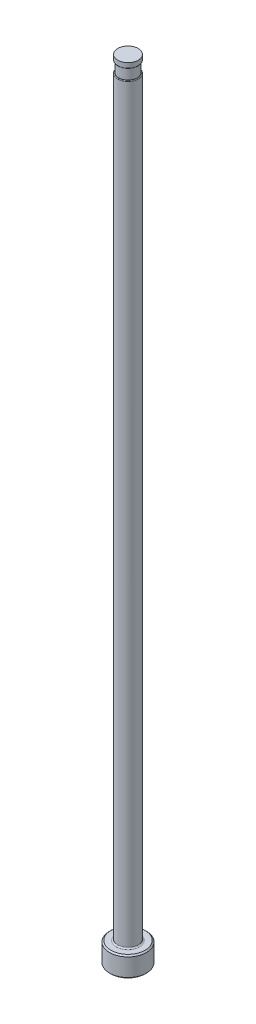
ISO-10303-21;
HEADER;
FILE_DESCRIPTION(('STEP AP214'),'2;1');
FILE_NAME('part.step','',(''),(''),'','','');
FILE_SCHEMA(('AUTOMOTIVE_DESIGN { 1 0 10303 214 1 1 1 1 }'));
ENDSEC;
DATA;
#1=APPLICATION_CONTEXT('core data for automotive mechanical design processes');
#2=APPLICATION_PROTOCOL_DEFINITION('international standard','automotive_design',2000,#1);
#3=PRODUCT_CONTEXT('',#1,'mechanical');
#4=PRODUCT('Part','Part','',(#3));
#5=PRODUCT_RELATED_PRODUCT_CATEGORY('part','',(#4));
#6=PRODUCT_DEFINITION_FORMATION('','',#4);
#7=PRODUCT_DEFINITION_CONTEXT('part definition',#1,'design');
#8=PRODUCT_DEFINITION('design','',#6,#7);
#9=PRODUCT_DEFINITION_SHAPE('','',#8);
#10=(LENGTH_UNIT() NAMED_UNIT(*) SI_UNIT(.MILLI.,.METRE.));
#11=(NAMED_UNIT(*) PLANE_ANGLE_UNIT() SI_UNIT($,.RADIAN.));
#12=(NAMED_UNIT(*) SI_UNIT($,.STERADIAN.) SOLID_ANGLE_UNIT());
#13=UNCERTAINTY_MEASURE_WITH_UNIT(LENGTH_MEASURE(1.E-05),#10,'distance_accuracy_value','');
#14=(GEOMETRIC_REPRESENTATION_CONTEXT(3) GLOBAL_UNCERTAINTY_ASSIGNED_CONTEXT((#13)) GLOBAL_UNIT_ASSIGNED_CONTEXT((#10,
#11,#12)) REPRESENTATION_CONTEXT('',''));
#15=CARTESIAN_POINT('',(0.,0.,0.));
#16=DIRECTION('',(0.,0.,1.));
#17=DIRECTION('',(1.,0.,0.));
#18=AXIS2_PLACEMENT_3D('',#15,#16,#17);
#19=CARTESIAN_POINT('',(-1.98373999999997,151.384,0.));
#20=DIRECTION('',(0.,1.,0.));
#21=DIRECTION('',(0.,0.,1.));
#22=AXIS2_PLACEMENT_3D('',#19,#20,#21);
#23=PLANE('',#22);
#24=CARTESIAN_POINT('',(0.,151.384,0.));
#25=DIRECTION('',(0.,1.,0.));
#26=DIRECTION('',(0.,0.,1.));
#27=AXIS2_PLACEMENT_3D('',#24,#25,#26);
#28=CIRCLE('',#27,1.85165999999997);
#29=CARTESIAN_POINT('',(0.,151.384,1.85165999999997));
#30=VERTEX_POINT('',#29);
#31=EDGE_CURVE('E11',#30,#30,#28,.F.);
#32=ORIENTED_EDGE('',*,*,#31,.T.);
#33=EDGE_LOOP('',(#32));
#34=FACE_BOUND('',#33,.T.);
#35=CARTESIAN_POINT('',(0.,151.384,0.));
#36=DIRECTION('',(0.,1.,0.));
#37=DIRECTION('',(0.,0.,1.));
#38=AXIS2_PLACEMENT_3D('',#35,#36,#37);
#39=CIRCLE('',#38,1.78053999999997);
#40=CARTESIAN_POINT('',(0.,151.384,1.78053999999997));
#41=VERTEX_POINT('',#40);
#42=EDGE_CURVE('E78',#41,#41,#39,.T.);
#43=ORIENTED_EDGE('',*,*,#42,.T.);
#44=EDGE_LOOP('',(#43));
#45=FACE_BOUND('',#44,.T.);
#46=ADVANCED_FACE('F36',(#34,#45),#23,.F.);
#47=CARTESIAN_POINT('',(0.,259.958771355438,0.));
#48=DIRECTION('',(0.,1.,0.));
#49=DIRECTION('',(0.,0.,1.));
#50=AXIS2_PLACEMENT_3D('',#47,#48,#49);
#51=CYLINDRICAL_SURFACE('',#50,1.98373999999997);
#52=DIRECTION('',(0.,1.,0.));
#53=VECTOR('',#52,1.);
#54=CARTESIAN_POINT('',(-1.78053999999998,259.958771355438,-0.874586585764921));
#55=LINE('',#54,#53);
#56=CARTESIAN_POINT('',(-1.78053999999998,149.225,-0.874586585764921));
#57=VERTEX_POINT('',#56);
#58=CARTESIAN_POINT('',(-1.78053999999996,86.868,-0.874586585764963));
#59=VERTEX_POINT('',#58);
#60=EDGE_CURVE('E73',#57,#59,#55,.F.);
#61=ORIENTED_EDGE('',*,*,#60,.F.);
#62=CARTESIAN_POINT('',(0.,149.225,0.));
#63=DIRECTION('',(0.,-1.,0.));
#64=DIRECTION('',(0.,0.,-1.));
#65=AXIS2_PLACEMENT_3D('',#62,#63,#64);
#66=CIRCLE('',#65,1.98373999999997);
#67=CARTESIAN_POINT('',(-1.78053999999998,149.225,0.874586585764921));
#68=VERTEX_POINT('',#67);
#69=EDGE_CURVE('E51',#57,#68,#66,.T.);
#70=ORIENTED_EDGE('',*,*,#69,.T.);
#71=DIRECTION('',(0.,1.,0.));
#72=VECTOR('',#71,1.);
#73=CARTESIAN_POINT('',(-1.78053999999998,259.958771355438,0.874586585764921));
#74=LINE('',#73,#72);
#75=CARTESIAN_POINT('',(-1.78053999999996,86.868,0.874586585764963));
#76=VERTEX_POINT('',#75);
#77=EDGE_CURVE('E84',#76,#68,#74,.T.);
#78=ORIENTED_EDGE('',*,*,#77,.F.);
#79=CARTESIAN_POINT('',(-1.78053999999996,86.868,-0.874586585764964));
#80=CARTESIAN_POINT('',(-1.78053865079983,86.8352968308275,-0.874582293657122));
#81=CARTESIAN_POINT('',(-1.78104579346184,86.8026048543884,-0.873557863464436));
#82=CARTESIAN_POINT('',(-1.78306050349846,86.7373726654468,-0.869440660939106));
#83=CARTESIAN_POINT('',(-1.78456837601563,86.7048325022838,-0.866347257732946));
#84=CARTESIAN_POINT('',(-1.79058935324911,86.6073142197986,-0.853877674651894));
#85=CARTESIAN_POINT('',(-1.7965995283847,86.542794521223,-0.841311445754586));
#86=CARTESIAN_POINT('',(-1.81216655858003,86.416456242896,-0.807234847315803));
#87=CARTESIAN_POINT('',(-1.82173064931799,86.3546434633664,-0.785706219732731));
#88=CARTESIAN_POINT('',(-1.84353272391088,86.2358109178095,-0.733090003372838));
#89=CARTESIAN_POINT('',(-1.85576409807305,86.1787797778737,-0.702025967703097));
#90=CARTESIAN_POINT('',(-1.87864294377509,86.0836691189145,-0.637816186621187));
#91=CARTESIAN_POINT('',(-1.88904107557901,86.0441900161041,-0.606655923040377));
#92=CARTESIAN_POINT('',(-1.9096749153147,85.9709072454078,-0.538182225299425));
#93=CARTESIAN_POINT('',(-1.91991077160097,85.9370980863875,-0.50087481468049));
#94=CARTESIAN_POINT('',(-1.93765949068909,85.8812104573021,-0.426534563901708));
#95=CARTESIAN_POINT('',(-1.94535058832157,85.8581335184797,-0.390297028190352));
#96=CARTESIAN_POINT('',(-1.95906883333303,85.8181265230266,-0.31426420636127));
#97=CARTESIAN_POINT('',(-1.965096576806,85.8011942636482,-0.274470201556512));
#98=CARTESIAN_POINT('',(-1.97485334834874,85.7742257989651,-0.192104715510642));
#99=CARTESIAN_POINT('',(-1.97857112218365,85.7642233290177,-0.149520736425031));
#100=CARTESIAN_POINT('',(-1.98320696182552,85.751797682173,-0.0631103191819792));
#101=CARTESIAN_POINT('',(-1.98412600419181,85.7493718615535,-0.0192843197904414));
#102=CARTESIAN_POINT('',(-1.98310107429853,85.752100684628,0.0642372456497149));
#103=CARTESIAN_POINT('',(-1.98140057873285,85.7566106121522,0.103958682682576));
#104=CARTESIAN_POINT('',(-1.97575922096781,85.7718264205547,0.182020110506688));
#105=CARTESIAN_POINT('',(-1.97181856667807,85.7825317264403,0.220360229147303));
#106=CARTESIAN_POINT('',(-1.96206992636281,85.8097141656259,0.294827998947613));
#107=CARTESIAN_POINT('',(-1.95625507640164,85.8262125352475,0.330946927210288));
#108=CARTESIAN_POINT('',(-1.9432907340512,85.8643152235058,0.400107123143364));
#109=CARTESIAN_POINT('',(-1.93614084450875,85.885921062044,0.433147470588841));
#110=CARTESIAN_POINT('',(-1.92029960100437,85.9359613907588,0.498934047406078));
#111=CARTESIAN_POINT('',(-1.91152531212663,85.9648706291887,0.531297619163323));
#112=CARTESIAN_POINT('',(-1.89377241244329,86.0270184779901,0.591469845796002));
#113=CARTESIAN_POINT('',(-1.88479370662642,86.0602591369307,0.619276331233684));
#114=CARTESIAN_POINT('',(-1.86569807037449,86.1363604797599,0.674838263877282));
#115=CARTESIAN_POINT('',(-1.85566100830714,86.1798824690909,0.701713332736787));
#116=CARTESIAN_POINT('',(-1.83693898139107,86.2704245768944,0.749356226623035));
#117=CARTESIAN_POINT('',(-1.82825528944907,86.3174479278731,0.770118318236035));
#118=CARTESIAN_POINT('',(-1.8111557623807,86.4241808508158,0.809629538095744));
#119=CARTESIAN_POINT('',(-1.8031876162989,86.4844653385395,0.827017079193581));
#120=CARTESIAN_POINT('',(-1.79067795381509,86.6070954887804,0.853764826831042));
#121=CARTESIAN_POINT('',(-1.78613494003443,86.6694402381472,0.863128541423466));
#122=CARTESIAN_POINT('',(-1.78247943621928,86.7547444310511,0.870628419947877));
#123=CARTESIAN_POINT('',(-1.78175210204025,86.7773874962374,0.872115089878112));
#124=CARTESIAN_POINT('',(-1.78078289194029,86.8226849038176,0.874092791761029));
#125=CARTESIAN_POINT('',(-1.78054010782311,86.8453391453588,0.874585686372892));
#126=CARTESIAN_POINT('',(-1.78053999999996,86.868,0.874586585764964));
#127=B_SPLINE_CURVE_WITH_KNOTS('',3,(#79,#80,#81,#82,#83,#84,#85,#86,#87,#88,#89,#90,#91,#92,
#93,#94,#95,#96,#97,#98,#99,#100,#101,#102,#103,#104,#105,#106,#107,#108,#109,#110,#111,#112,
#113,#114,#115,#116,#117,#118,#119,#120,#121,#122,#123,#124,#125,#126),.UNSPECIFIED.,.F.,.F.,(4,
2,2,2,2,2,2,2,2,2,2,2,2,2,2,2,2,2,2,2,2,2,2,4),(0.,0.098066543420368,0.196163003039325,
0.39341501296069,0.591070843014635,0.78824232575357,0.941736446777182,1.09508104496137,
1.22546509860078,1.35580236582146,1.48676976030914,1.6176914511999,1.73715752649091,
1.85661251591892,1.97651005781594,2.0964433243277,2.22876073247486,2.36114094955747,
2.51695507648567,2.67291488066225,2.86196277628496,3.05092797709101,3.11901829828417,
3.18698087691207),.UNSPECIFIED.);
#128=EDGE_CURVE('E81',#59,#76,#127,.T.);
#129=ORIENTED_EDGE('',*,*,#128,.F.);
#130=EDGE_LOOP('',(#61,#70,#78,#129));
#131=FACE_BOUND('',#130,.T.);
#132=CARTESIAN_POINT('',(0.,4.21640000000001,0.));
#133=DIRECTION('',(0.,1.,0.));
#134=DIRECTION('',(0.,0.,1.));
#135=AXIS2_PLACEMENT_3D('',#132,#133,#134);
#136=CIRCLE('',#135,1.98373999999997);
#137=CARTESIAN_POINT('',(0.,4.21640000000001,1.98373999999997));
#138=VERTEX_POINT('',#137);
#139=EDGE_CURVE('E116',#138,#138,#136,.T.);
#140=ORIENTED_EDGE('',*,*,#139,.T.);
#141=EDGE_LOOP('',(#140));
#142=FACE_BOUND('',#141,.T.);
#143=ADVANCED_FACE('F82',(#131,#142),#51,.T.);
#144=CARTESIAN_POINT('',(0.,0.,0.));
#145=DIRECTION('',(0.,-1.,0.));
#146=DIRECTION('',(0.,0.,-1.));
#147=AXIS2_PLACEMENT_3D('',#144,#145,#146);
#148=PLANE('',#147);
#149=CARTESIAN_POINT('',(0.,0.,0.));
#150=DIRECTION('',(0.,-1.,0.));
#151=DIRECTION('',(0.,0.,-1.));
#152=AXIS2_PLACEMENT_3D('',#149,#150,#151);
#153=CIRCLE('',#152,3.31469999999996);
#154=CARTESIAN_POINT('',(0.,0.,-3.31469999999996));
#155=VERTEX_POINT('',#154);
#156=EDGE_CURVE('E113',#155,#155,#153,.T.);
#157=ORIENTED_EDGE('',*,*,#156,.T.);
#158=EDGE_LOOP('',(#157));
#159=FACE_BOUND('',#158,.T.);
#160=ADVANCED_FACE('F192',(#159),#148,.T.);
#161=CARTESIAN_POINT('',(0.,259.958771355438,0.));
#162=DIRECTION('',(0.,1.,0.));
#163=DIRECTION('',(0.,0.,1.));
#164=AXIS2_PLACEMENT_3D('',#161,#162,#163);
#165=CYLINDRICAL_SURFACE('',#164,3.56869999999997);
#166=CARTESIAN_POINT('',(0.,3.70839999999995,0.));
#167=DIRECTION('',(0.,1.,0.));
#168=DIRECTION('',(0.,0.,1.));
#169=AXIS2_PLACEMENT_3D('',#166,#167,#168);
#170=CIRCLE('',#169,3.56869999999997);
#171=CARTESIAN_POINT('',(0.,3.70839999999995,3.56869999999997));
#172=VERTEX_POINT('',#171);
#173=EDGE_CURVE('E110',#172,#172,#170,.F.);
#174=ORIENTED_EDGE('',*,*,#173,.T.);
#175=EDGE_LOOP('',(#174));
#176=FACE_BOUND('',#175,.T.);
#177=CARTESIAN_POINT('',(0.,0.254000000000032,0.));
#178=DIRECTION('',(0.,-1.,0.));
#179=DIRECTION('',(0.,0.,-1.));
#180=AXIS2_PLACEMENT_3D('',#177,#178,#179);
#181=CIRCLE('',#180,3.56869999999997);
#182=CARTESIAN_POINT('',(0.,0.254000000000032,-3.56869999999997));
#183=VERTEX_POINT('',#182);
#184=EDGE_CURVE('E107',#183,#183,#181,.F.);
#185=ORIENTED_EDGE('',*,*,#184,.T.);
#186=EDGE_LOOP('',(#185));
#187=FACE_BOUND('',#186,.T.);
#188=ADVANCED_FACE('F195',(#176,#187),#165,.T.);
#189=CARTESIAN_POINT('',(-3.56869999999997,3.9624,0.));
#190=DIRECTION('',(0.,1.,0.));
#191=DIRECTION('',(0.,0.,1.));
#192=AXIS2_PLACEMENT_3D('',#189,#190,#191);
#193=PLANE('',#192);
#194=CARTESIAN_POINT('',(0.,3.9624,0.));
#195=DIRECTION('',(0.,1.,0.));
#196=DIRECTION('',(0.,0.,1.));
#197=AXIS2_PLACEMENT_3D('',#194,#195,#196);
#198=CIRCLE('',#197,2.23773999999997);
#199=CARTESIAN_POINT('',(0.,3.9624,2.23773999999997));
#200=VERTEX_POINT('',#199);
#201=EDGE_CURVE('E87',#200,#200,#198,.F.);
#202=ORIENTED_EDGE('',*,*,#201,.T.);
#203=EDGE_LOOP('',(#202));
#204=FACE_BOUND('',#203,.T.);
#205=CARTESIAN_POINT('',(0.,3.9624,0.));
#206=DIRECTION('',(0.,1.,0.));
#207=DIRECTION('',(0.,0.,1.));
#208=AXIS2_PLACEMENT_3D('',#205,#206,#207);
#209=CIRCLE('',#208,3.31469999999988);
#210=CARTESIAN_POINT('',(0.,3.9624,3.31469999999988));
#211=VERTEX_POINT('',#210);
#212=EDGE_CURVE('E104',#211,#211,#209,.T.);
#213=ORIENTED_EDGE('',*,*,#212,.T.);
#214=EDGE_LOOP('',(#213));
#215=FACE_BOUND('',#214,.T.);
#216=ADVANCED_FACE('F190',(#204,#215),#193,.T.);
#217=CARTESIAN_POINT('',(0.,3.96239999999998,0.));
#218=DIRECTION('',(0.,-1.,0.));
#219=DIRECTION('',(0.,0.,-1.));
#220=AXIS2_PLACEMENT_3D('',#217,#218,#219);
#221=CONICAL_SURFACE('',#220,3.31469999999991,0.785398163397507);
#222=ORIENTED_EDGE('',*,*,#173,.F.);
#223=EDGE_LOOP('',(#222));
#224=FACE_BOUND('',#223,.T.);
#225=ORIENTED_EDGE('',*,*,#212,.F.);
#226=EDGE_LOOP('',(#225));
#227=FACE_BOUND('',#226,.T.);
#228=ADVANCED_FACE('F186',(#224,#227),#221,.T.);
#229=CARTESIAN_POINT('',(0.,0.254000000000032,0.));
#230=DIRECTION('',(0.,1.,0.));
#231=DIRECTION('',(0.,0.,1.));
#232=AXIS2_PLACEMENT_3D('',#229,#230,#231);
#233=CONICAL_SURFACE('',#232,3.56869999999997,0.785398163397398);
#234=ORIENTED_EDGE('',*,*,#156,.F.);
#235=EDGE_LOOP('',(#234));
#236=FACE_BOUND('',#235,.T.);
#237=ORIENTED_EDGE('',*,*,#184,.F.);
#238=EDGE_LOOP('',(#237));
#239=FACE_BOUND('',#238,.T.);
#240=ADVANCED_FACE('F182',(#236,#239),#233,.T.);
#241=CARTESIAN_POINT('',(0.,4.21640000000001,0.));
#242=DIRECTION('',(0.,1.,0.));
#243=DIRECTION('',(0.,0.,1.));
#244=AXIS2_PLACEMENT_3D('',#241,#242,#243);
#245=TOROIDAL_SURFACE('',#244,2.23773999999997,0.254);
#246=ORIENTED_EDGE('',*,*,#201,.F.);
#247=EDGE_LOOP('',(#246));
#248=FACE_BOUND('',#247,.T.);
#249=ORIENTED_EDGE('',*,*,#139,.F.);
#250=EDGE_LOOP('',(#249));
#251=FACE_BOUND('',#250,.T.);
#252=ADVANCED_FACE('F147',(#248,#251),#245,.F.);
#253=CARTESIAN_POINT('',(-1.98373999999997,149.352,0.));
#254=DIRECTION('',(0.,-1.,0.));
#255=DIRECTION('',(0.,0.,-1.));
#256=AXIS2_PLACEMENT_3D('',#253,#254,#255);
#257=PLANE('',#256);
#258=DIRECTION('',(0.,0.,1.));
#259=VECTOR('',#258,1.);
#260=CARTESIAN_POINT('',(-1.78053999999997,149.352,0.));
#261=LINE('',#260,#259);
#262=CARTESIAN_POINT('',(-1.78053999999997,149.352,0.));
#263=VERTEX_POINT('',#262);
#264=CARTESIAN_POINT('',(-1.78053999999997,149.352,0.526460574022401));
#265=VERTEX_POINT('',#264);
#266=EDGE_CURVE('E90',#263,#265,#261,.T.);
#267=ORIENTED_EDGE('',*,*,#266,.T.);
#268=CARTESIAN_POINT('',(0.,149.352,0.));
#269=DIRECTION('',(0.,-1.,0.));
#270=DIRECTION('',(0.,0.,-1.));
#271=AXIS2_PLACEMENT_3D('',#268,#269,#270);
#272=CIRCLE('',#271,1.85673999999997);
#273=CARTESIAN_POINT('',(-1.78053999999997,149.352,-0.526460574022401));
#274=VERTEX_POINT('',#273);
#275=EDGE_CURVE('E86',#265,#274,#272,.F.);
#276=ORIENTED_EDGE('',*,*,#275,.T.);
#277=EDGE_CURVE('E79',#274,#263,#261,.T.);
#278=ORIENTED_EDGE('',*,*,#277,.T.);
#279=CARTESIAN_POINT('',(0.,149.352,0.));
#280=DIRECTION('',(0.,1.,0.));
#281=DIRECTION('',(0.,0.,1.));
#282=AXIS2_PLACEMENT_3D('',#279,#280,#281);
#283=CIRCLE('',#282,1.78053999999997);
#284=EDGE_CURVE('E101',#263,#263,#283,.T.);
#285=ORIENTED_EDGE('',*,*,#284,.F.);
#286=EDGE_LOOP('',(#267,#276,#278,#285));
#287=FACE_BOUND('',#286,.T.);
#288=ADVANCED_FACE('F144',(#287),#257,.F.);
#289=CARTESIAN_POINT('',(0.,153.448281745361,0.));
#290=DIRECTION('',(0.,1.,0.));
#291=DIRECTION('',(0.,0.,1.));
#292=AXIS2_PLACEMENT_3D('',#289,#290,#291);
#293=CYLINDRICAL_SURFACE('',#292,1.78053999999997);
#294=ORIENTED_EDGE('',*,*,#42,.F.);
#295=EDGE_LOOP('',(#294));
#296=FACE_BOUND('',#295,.T.);
#297=ORIENTED_EDGE('',*,*,#284,.T.);
#298=EDGE_LOOP('',(#297));
#299=FACE_BOUND('',#298,.T.);
#300=ADVANCED_FACE('F141',(#296,#299),#293,.T.);
#301=CARTESIAN_POINT('',(-1.78053999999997,150.368,-3.56869999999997));
#302=DIRECTION('',(1.,0.,0.));
#303=DIRECTION('',(0.,1.,0.));
#304=AXIS2_PLACEMENT_3D('',#301,#302,#303);
#305=PLANE('',#304);
#306=ORIENTED_EDGE('',*,*,#277,.F.);
#307=CARTESIAN_POINT('',(-1.78053999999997,149.352,-0.526460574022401));
#308=CARTESIAN_POINT('',(-1.78053999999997,149.351978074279,-0.547390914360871));
#309=CARTESIAN_POINT('',(-1.78053999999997,149.35158039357,-0.568347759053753));
#310=CARTESIAN_POINT('',(-1.78053999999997,149.349614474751,-0.610487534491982));
#311=CARTESIAN_POINT('',(-1.78053999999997,149.348030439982,-0.631669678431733));
#312=CARTESIAN_POINT('',(-1.78053999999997,149.343173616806,-0.67454186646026));
#313=CARTESIAN_POINT('',(-1.78053999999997,149.339847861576,-0.696226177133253));
#314=CARTESIAN_POINT('',(-1.78053999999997,149.330728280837,-0.739006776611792));
#315=CARTESIAN_POINT('',(-1.78053999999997,149.324950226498,-0.760105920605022));
#316=CARTESIAN_POINT('',(-1.78053999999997,149.314654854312,-0.78714757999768));
#317=CARTESIAN_POINT('',(-1.78053999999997,149.311896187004,-0.793754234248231));
#318=CARTESIAN_POINT('',(-1.78053999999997,149.305851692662,-0.806726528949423));
#319=CARTESIAN_POINT('',(-1.78053999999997,149.302565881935,-0.813092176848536));
#320=CARTESIAN_POINT('',(-1.78053999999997,149.295320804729,-0.82550926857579));
#321=CARTESIAN_POINT('',(-1.78053999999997,149.291355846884,-0.83155744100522));
#322=CARTESIAN_POINT('',(-1.78053999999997,149.28261692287,-0.843040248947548));
#323=CARTESIAN_POINT('',(-1.78053999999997,149.277845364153,-0.84847663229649));
#324=CARTESIAN_POINT('',(-1.78053999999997,149.269648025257,-0.856139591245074));
#325=CARTESIAN_POINT('',(-1.78053999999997,149.266558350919,-0.858723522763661));
#326=CARTESIAN_POINT('',(-1.78053999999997,149.260050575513,-0.863452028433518));
#327=CARTESIAN_POINT('',(-1.78053999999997,149.256632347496,-0.865596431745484));
#328=CARTESIAN_POINT('',(-1.78053999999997,149.249433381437,-0.869319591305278));
#329=CARTESIAN_POINT('',(-1.78053999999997,149.245648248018,-0.870890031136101));
#330=CARTESIAN_POINT('',(-1.78053999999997,149.237845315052,-0.873246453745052));
#331=CARTESIAN_POINT('',(-1.78053999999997,149.233828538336,-0.874035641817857));
#332=CARTESIAN_POINT('',(-1.78053999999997,149.228987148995,-0.8744503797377));
#333=CARTESIAN_POINT('',(-1.78053999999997,149.22819041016,-0.874501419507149));
#334=CARTESIAN_POINT('',(-1.78053999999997,149.226595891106,-0.874569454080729));
#335=CARTESIAN_POINT('',(-1.78053999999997,149.225798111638,-0.874586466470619));
#336=CARTESIAN_POINT('',(-1.78053999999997,149.225,-0.874586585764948));
#337=B_SPLINE_CURVE_WITH_KNOTS('',3,(#307,#308,#309,#310,#311,#312,#313,#314,#315,#316,#317,
#318,#319,#320,#321,#322,#323,#324,#325,#326,#327,#328,#329,#330,#331,#332,#333,#334,#335,#336),
.UNSPECIFIED.,.F.,.F.,(4,2,2,2,2,2,2,2,2,2,2,2,2,2,4),(0.,0.0628307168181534,0.126513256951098,
0.192255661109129,0.257581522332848,0.279042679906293,0.30050317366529,0.322153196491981,
0.343739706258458,0.355794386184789,0.367853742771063,0.380081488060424,0.392258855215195,
0.39465358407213,0.397047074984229),.UNSPECIFIED.);
#338=EDGE_CURVE('E59',#274,#57,#337,.T.);
#339=ORIENTED_EDGE('',*,*,#338,.T.);
#340=ORIENTED_EDGE('',*,*,#60,.T.);
#341=DIRECTION('',(0.,0.,1.));
#342=VECTOR('',#341,1.);
#343=CARTESIAN_POINT('',(-1.78053999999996,86.868,-3.56869999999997));
#344=LINE('',#343,#342);
#345=EDGE_CURVE('E77',#59,#76,#344,.T.);
#346=ORIENTED_EDGE('',*,*,#345,.T.);
#347=ORIENTED_EDGE('',*,*,#77,.T.);
#348=CARTESIAN_POINT('',(-1.78053999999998,149.225,0.874586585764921));
#349=CARTESIAN_POINT('',(-1.78053999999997,149.228428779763,0.874595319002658));
#350=CARTESIAN_POINT('',(-1.78053999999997,149.23184637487,0.874272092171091));
#351=CARTESIAN_POINT('',(-1.78053999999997,149.238538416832,0.873041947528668));
#352=CARTESIAN_POINT('',(-1.78053999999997,149.241814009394,0.872141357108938));
#353=CARTESIAN_POINT('',(-1.78053999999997,149.248906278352,0.869569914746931));
#354=CARTESIAN_POINT('',(-1.78053999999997,149.252675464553,0.867770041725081));
#355=CARTESIAN_POINT('',(-1.78053999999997,149.259882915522,0.863582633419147));
#356=CARTESIAN_POINT('',(-1.78053999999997,149.263319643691,0.861192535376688));
#357=CARTESIAN_POINT('',(-1.78053999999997,149.271682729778,0.854521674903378));
#358=CARTESIAN_POINT('',(-1.78053999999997,149.276361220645,0.849933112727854));
#359=CARTESIAN_POINT('',(-1.78053999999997,149.284984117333,0.840123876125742));
#360=CARTESIAN_POINT('',(-1.78053999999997,149.288927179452,0.834902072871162));
#361=CARTESIAN_POINT('',(-1.78053999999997,149.299616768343,0.819005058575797));
#362=CARTESIAN_POINT('',(-1.78053999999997,149.305546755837,0.807787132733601));
#363=CARTESIAN_POINT('',(-1.78053999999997,149.315885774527,0.784614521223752));
#364=CARTESIAN_POINT('',(-1.78053999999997,149.320281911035,0.772654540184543));
#365=CARTESIAN_POINT('',(-1.78053999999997,149.330197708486,0.741171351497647));
#366=CARTESIAN_POINT('',(-1.78053999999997,149.334834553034,0.721373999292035));
#367=CARTESIAN_POINT('',(-1.78053999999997,149.342183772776,0.681384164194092));
#368=CARTESIAN_POINT('',(-1.78053999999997,149.344888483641,0.661190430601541));
#369=CARTESIAN_POINT('',(-1.78053999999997,149.348786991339,0.62184007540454));
#370=CARTESIAN_POINT('',(-1.78053999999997,149.350058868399,0.602690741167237));
#371=CARTESIAN_POINT('',(-1.78053999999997,149.351654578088,0.564509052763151));
#372=CARTESIAN_POINT('',(-1.78053999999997,149.351986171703,0.545477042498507));
#373=CARTESIAN_POINT('',(-1.78053999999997,149.352,0.526460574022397));
#374=B_SPLINE_CURVE_WITH_KNOTS('',3,(#348,#349,#350,#351,#352,#353,#354,#355,#356,#357,#358,
#359,#360,#361,#362,#363,#364,#365,#366,#367,#368,#369,#370,#371,#372,#373),.UNSPECIFIED.,.F.,
.F.,(4,2,2,2,2,2,2,2,2,2,2,2,4),(0.,0.010253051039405,0.0203956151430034,0.0328568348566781,
0.0453731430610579,0.0649213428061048,0.084504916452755,0.122359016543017,0.160524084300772,
0.221350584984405,0.282417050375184,0.339964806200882,0.397036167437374),.UNSPECIFIED.);
#375=EDGE_CURVE('E172',#68,#265,#374,.T.);
#376=ORIENTED_EDGE('',*,*,#375,.T.);
#377=ORIENTED_EDGE('',*,*,#266,.F.);
#378=EDGE_LOOP('',(#306,#339,#340,#346,#347,#376,#377));
#379=FACE_BOUND('',#378,.T.);
#380=ADVANCED_FACE('F75',(#379),#305,.F.);
#381=CARTESIAN_POINT('',(-4.95553999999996,86.868,-3.56869999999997));
#382=DIRECTION('',(0.,0.,1.));
#383=DIRECTION('',(1.,0.,0.));
#384=AXIS2_PLACEMENT_3D('',#381,#382,#383);
#385=CYLINDRICAL_SURFACE('',#384,3.175);
#386=ORIENTED_EDGE('',*,*,#345,.F.);
#387=ORIENTED_EDGE('',*,*,#128,.T.);
#388=EDGE_LOOP('',(#386,#387));
#389=FACE_BOUND('',#388,.T.);
#390=ADVANCED_FACE('F89',(#389),#385,.F.);
#391=CARTESIAN_POINT('',(0.,152.687735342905,0.));
#392=DIRECTION('',(0.,1.,0.));
#393=DIRECTION('',(0.,0.,1.));
#394=AXIS2_PLACEMENT_3D('',#391,#392,#393);
#395=CYLINDRICAL_SURFACE('',#394,1.97865999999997);
#396=CARTESIAN_POINT('',(0.,151.511,0.));
#397=DIRECTION('',(0.,1.,0.));
#398=DIRECTION('',(0.,0.,1.));
#399=AXIS2_PLACEMENT_3D('',#396,#397,#398);
#400=CIRCLE('',#399,1.97865999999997);
#401=CARTESIAN_POINT('',(0.,151.511,1.97865999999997));
#402=VERTEX_POINT('',#401);
#403=EDGE_CURVE('E44',#402,#402,#400,.T.);
#404=ORIENTED_EDGE('',*,*,#403,.T.);
#405=EDGE_LOOP('',(#404));
#406=FACE_BOUND('',#405,.T.);
#407=CARTESIAN_POINT('',(0.,152.4,0.));
#408=DIRECTION('',(0.,1.,0.));
#409=DIRECTION('',(0.,0.,1.));
#410=AXIS2_PLACEMENT_3D('',#407,#408,#409);
#411=CIRCLE('',#410,1.97865999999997);
#412=CARTESIAN_POINT('',(0.,152.4,1.97865999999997));
#413=VERTEX_POINT('',#412);
#414=EDGE_CURVE('E91',#413,#413,#411,.T.);
#415=ORIENTED_EDGE('',*,*,#414,.F.);
#416=EDGE_LOOP('',(#415));
#417=FACE_BOUND('',#416,.T.);
#418=ADVANCED_FACE('F135',(#406,#417),#395,.T.);
#419=CARTESIAN_POINT('',(-1.98373999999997,152.4,0.));
#420=DIRECTION('',(0.,1.,0.));
#421=DIRECTION('',(0.,0.,1.));
#422=AXIS2_PLACEMENT_3D('',#419,#420,#421);
#423=PLANE('',#422);
#424=ORIENTED_EDGE('',*,*,#414,.T.);
#425=EDGE_LOOP('',(#424));
#426=FACE_BOUND('',#425,.T.);
#427=ADVANCED_FACE('F149',(#426),#423,.T.);
#428=CARTESIAN_POINT('',(0.,149.225,0.));
#429=DIRECTION('',(0.,-1.,0.));
#430=DIRECTION('',(0.,0.,-1.));
#431=AXIS2_PLACEMENT_3D('',#428,#429,#430);
#432=TOROIDAL_SURFACE('',#431,1.85673999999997,0.127);
#433=ORIENTED_EDGE('',*,*,#375,.F.);
#434=ORIENTED_EDGE('',*,*,#69,.F.);
#435=ORIENTED_EDGE('',*,*,#338,.F.);
#436=ORIENTED_EDGE('',*,*,#275,.F.);
#437=EDGE_LOOP('',(#433,#434,#435,#436));
#438=FACE_BOUND('',#437,.T.);
#439=ADVANCED_FACE('F151',(#438),#432,.T.);
#440=CARTESIAN_POINT('',(0.,151.511,0.));
#441=DIRECTION('',(0.,1.,0.));
#442=DIRECTION('',(0.,0.,1.));
#443=AXIS2_PLACEMENT_3D('',#440,#441,#442);
#444=TOROIDAL_SURFACE('',#443,1.85165999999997,0.127);
#445=ORIENTED_EDGE('',*,*,#31,.F.);
#446=EDGE_LOOP('',(#445));
#447=FACE_BOUND('',#446,.T.);
#448=ORIENTED_EDGE('',*,*,#403,.F.);
#449=EDGE_LOOP('',(#448));
#450=FACE_BOUND('',#449,.T.);
#451=ADVANCED_FACE('F38',(#447,#450),#444,.T.);
#452=CLOSED_SHELL('',(#46,#143,#160,#188,#216,#228,#240,#252,#288,#300,#380,#390,#418,#427,#439,#451));
#453=MANIFOLD_SOLID_BREP('B2',#452);
#454=ADVANCED_BREP_SHAPE_REPRESENTATION('',(#18,#453),#14);
#455=SHAPE_DEFINITION_REPRESENTATION(#9,#454);
ENDSEC;
END-ISO-10303-21;
